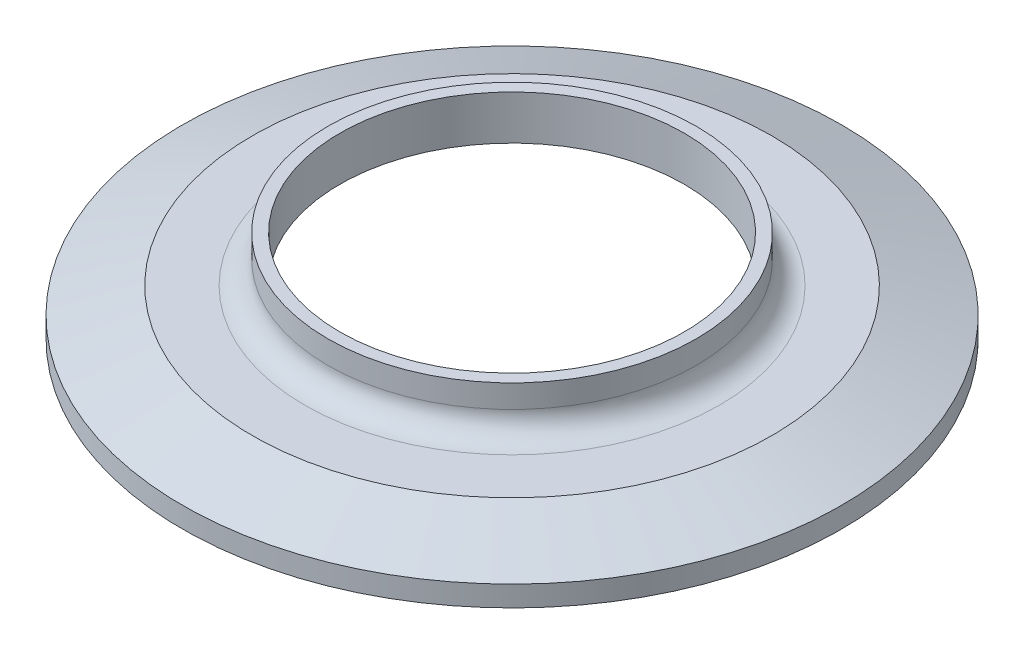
ISO-10303-21;
HEADER;
FILE_DESCRIPTION(('STEP AP214'),'2;1');
FILE_NAME('part.step','',(''),(''),'','','');
FILE_SCHEMA(('AUTOMOTIVE_DESIGN { 1 0 10303 214 1 1 1 1 }'));
ENDSEC;
DATA;
#1=APPLICATION_CONTEXT('core data for automotive mechanical design processes');
#2=APPLICATION_PROTOCOL_DEFINITION('international standard','automotive_design',2000,#1);
#3=PRODUCT_CONTEXT('',#1,'mechanical');
#4=PRODUCT('Part','Part','',(#3));
#5=PRODUCT_RELATED_PRODUCT_CATEGORY('part','',(#4));
#6=PRODUCT_DEFINITION_FORMATION('','',#4);
#7=PRODUCT_DEFINITION_CONTEXT('part definition',#1,'design');
#8=PRODUCT_DEFINITION('design','',#6,#7);
#9=PRODUCT_DEFINITION_SHAPE('','',#8);
#10=(LENGTH_UNIT() NAMED_UNIT(*) SI_UNIT(.MILLI.,.METRE.));
#11=(NAMED_UNIT(*) PLANE_ANGLE_UNIT() SI_UNIT($,.RADIAN.));
#12=(NAMED_UNIT(*) SI_UNIT($,.STERADIAN.) SOLID_ANGLE_UNIT());
#13=UNCERTAINTY_MEASURE_WITH_UNIT(LENGTH_MEASURE(1.E-05),#10,'distance_accuracy_value','');
#14=(GEOMETRIC_REPRESENTATION_CONTEXT(3) GLOBAL_UNCERTAINTY_ASSIGNED_CONTEXT((#13)) GLOBAL_UNIT_ASSIGNED_CONTEXT((#10,
#11,#12)) REPRESENTATION_CONTEXT('',''));
#15=CARTESIAN_POINT('',(0.,0.,0.));
#16=DIRECTION('',(0.,0.,1.));
#17=DIRECTION('',(1.,0.,0.));
#18=AXIS2_PLACEMENT_3D('',#15,#16,#17);
#19=CARTESIAN_POINT('',(-23.749,12.7,0.));
#20=DIRECTION('',(0.,-1.,0.));
#21=DIRECTION('',(0.,0.,-0.999999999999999));
#22=AXIS2_PLACEMENT_3D('',#19,#20,#21);
#23=PLANE('',#22);
#24=CARTESIAN_POINT('',(0.,12.7,0.));
#25=DIRECTION('',(0.,-1.,0.));
#26=DIRECTION('',(0.,0.,-0.999999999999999));
#27=AXIS2_PLACEMENT_3D('',#24,#25,#26);
#28=CIRCLE('',#27,25.4);
#29=CARTESIAN_POINT('',(0.,12.7,-25.4));
#30=VERTEX_POINT('',#29);
#31=EDGE_CURVE('E12',#30,#30,#28,.T.);
#32=ORIENTED_EDGE('',*,*,#31,.F.);
#33=EDGE_LOOP('',(#32));
#34=FACE_BOUND('',#33,.T.);
#35=CARTESIAN_POINT('',(0.,12.7,0.));
#36=DIRECTION('',(0.,-1.,0.));
#37=DIRECTION('',(0.,0.,-0.999999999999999));
#38=AXIS2_PLACEMENT_3D('',#35,#36,#37);
#39=CIRCLE('',#38,23.749);
#40=CARTESIAN_POINT('',(0.,12.7,-23.749));
#41=VERTEX_POINT('',#40);
#42=EDGE_CURVE('E87',#41,#41,#39,.T.);
#43=ORIENTED_EDGE('',*,*,#42,.T.);
#44=EDGE_LOOP('',(#43));
#45=FACE_BOUND('',#44,.T.);
#46=ADVANCED_FACE('F38',(#34,#45),#23,.F.);
#47=CARTESIAN_POINT('',(0.,0.,0.));
#48=DIRECTION('',(0.,-1.,0.));
#49=DIRECTION('',(0.,0.,-0.999999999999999));
#50=AXIS2_PLACEMENT_3D('',#47,#48,#49);
#51=CYLINDRICAL_SURFACE('',#50,25.4);
#52=CARTESIAN_POINT('',(0.,9.52499999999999,0.));
#53=DIRECTION('',(0.,-1.,0.));
#54=DIRECTION('',(0.,0.,-0.999999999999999));
#55=AXIS2_PLACEMENT_3D('',#52,#53,#54);
#56=CIRCLE('',#55,25.4);
#57=CARTESIAN_POINT('',(0.,9.52499999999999,-25.4));
#58=VERTEX_POINT('',#57);
#59=EDGE_CURVE('E44',#58,#58,#56,.T.);
#60=ORIENTED_EDGE('',*,*,#59,.F.);
#61=EDGE_LOOP('',(#60));
#62=FACE_BOUND('',#61,.T.);
#63=ORIENTED_EDGE('',*,*,#31,.T.);
#64=EDGE_LOOP('',(#63));
#65=FACE_BOUND('',#64,.T.);
#66=ADVANCED_FACE('F166',(#62,#65),#51,.T.);
#67=CARTESIAN_POINT('',(0.,9.52499999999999,0.));
#68=DIRECTION('',(0.,-1.,0.));
#69=DIRECTION('',(0.,0.,-0.999999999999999));
#70=AXIS2_PLACEMENT_3D('',#67,#68,#69);
#71=TOROIDAL_SURFACE('',#70,28.575,3.175);
#72=CARTESIAN_POINT('',(0.,6.34999999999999,0.));
#73=DIRECTION('',(0.,-1.,0.));
#74=DIRECTION('',(0.,0.,-0.999999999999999));
#75=AXIS2_PLACEMENT_3D('',#72,#73,#74);
#76=CIRCLE('',#75,28.575);
#77=CARTESIAN_POINT('',(0.,6.34999999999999,-28.575));
#78=VERTEX_POINT('',#77);
#79=EDGE_CURVE('E48',#78,#78,#76,.T.);
#80=ORIENTED_EDGE('',*,*,#79,.F.);
#81=EDGE_LOOP('',(#80));
#82=FACE_BOUND('',#81,.T.);
#83=ORIENTED_EDGE('',*,*,#59,.T.);
#84=EDGE_LOOP('',(#83));
#85=FACE_BOUND('',#84,.T.);
#86=ADVANCED_FACE('F161',(#82,#85),#71,.F.);
#87=CARTESIAN_POINT('',(-28.5749999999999,6.34999999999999,0.));
#88=DIRECTION('',(0.,-1.,0.));
#89=DIRECTION('',(0.,0.,-0.999999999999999));
#90=AXIS2_PLACEMENT_3D('',#87,#88,#89);
#91=PLANE('',#90);
#92=CARTESIAN_POINT('',(0.,6.34999999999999,0.));
#93=DIRECTION('',(0.,-1.,0.));
#94=DIRECTION('',(0.,0.,-0.999999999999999));
#95=AXIS2_PLACEMENT_3D('',#92,#93,#94);
#96=CIRCLE('',#95,35.8228421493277);
#97=CARTESIAN_POINT('',(0.,6.34999999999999,-35.8228421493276));
#98=VERTEX_POINT('',#97);
#99=EDGE_CURVE('E52',#98,#98,#96,.T.);
#100=ORIENTED_EDGE('',*,*,#99,.F.);
#101=EDGE_LOOP('',(#100));
#102=FACE_BOUND('',#101,.T.);
#103=ORIENTED_EDGE('',*,*,#79,.T.);
#104=EDGE_LOOP('',(#103));
#105=FACE_BOUND('',#104,.T.);
#106=ADVANCED_FACE('F155',(#102,#105),#91,.F.);
#107=CARTESIAN_POINT('',(0.,6.34999999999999,0.));
#108=DIRECTION('',(0.,-1.,0.));
#109=DIRECTION('',(0.,0.,-0.999999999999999));
#110=AXIS2_PLACEMENT_3D('',#107,#108,#109);
#111=CONICAL_SURFACE('',#110,35.8228421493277,1.22173047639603);
#112=CARTESIAN_POINT('',(0.,2.84479999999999,0.));
#113=DIRECTION('',(0.,-1.,0.));
#114=DIRECTION('',(0.,0.,-0.999999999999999));
#115=AXIS2_PLACEMENT_3D('',#112,#113,#114);
#116=CIRCLE('',#115,45.4533);
#117=CARTESIAN_POINT('',(0.,2.84479999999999,-45.4533));
#118=VERTEX_POINT('',#117);
#119=EDGE_CURVE('E57',#118,#118,#116,.T.);
#120=ORIENTED_EDGE('',*,*,#119,.F.);
#121=EDGE_LOOP('',(#120));
#122=FACE_BOUND('',#121,.T.);
#123=ORIENTED_EDGE('',*,*,#99,.T.);
#124=EDGE_LOOP('',(#123));
#125=FACE_BOUND('',#124,.T.);
#126=ADVANCED_FACE('F149',(#122,#125),#111,.T.);
#127=CARTESIAN_POINT('',(0.,0.,0.));
#128=DIRECTION('',(0.,-1.,0.));
#129=DIRECTION('',(0.,0.,-0.999999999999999));
#130=AXIS2_PLACEMENT_3D('',#127,#128,#129);
#131=CYLINDRICAL_SURFACE('',#130,45.4533);
#132=CARTESIAN_POINT('',(0.,0.,0.));
#133=DIRECTION('',(0.,-1.,0.));
#134=DIRECTION('',(0.,0.,-0.999999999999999));
#135=AXIS2_PLACEMENT_3D('',#132,#133,#134);
#136=CIRCLE('',#135,45.4533);
#137=CARTESIAN_POINT('',(0.,0.,-45.4533));
#138=VERTEX_POINT('',#137);
#139=EDGE_CURVE('E60',#138,#138,#136,.T.);
#140=ORIENTED_EDGE('',*,*,#139,.F.);
#141=EDGE_LOOP('',(#140));
#142=FACE_BOUND('',#141,.T.);
#143=ORIENTED_EDGE('',*,*,#119,.T.);
#144=EDGE_LOOP('',(#143));
#145=FACE_BOUND('',#144,.T.);
#146=ADVANCED_FACE('F143',(#142,#145),#131,.T.);
#147=CARTESIAN_POINT('',(0.,0.,0.));
#148=DIRECTION('',(0.,-1.,0.));
#149=DIRECTION('',(0.,0.,-0.999999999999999));
#150=AXIS2_PLACEMENT_3D('',#147,#148,#149);
#151=CONICAL_SURFACE('',#150,45.4533,1.56939586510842);
#152=CARTESIAN_POINT('',(0.,0.0025124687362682,0.));
#153=DIRECTION('',(0.,-1.,0.));
#154=DIRECTION('',(0.,0.,-0.999999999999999));
#155=AXIS2_PLACEMENT_3D('',#152,#153,#154);
#156=CIRCLE('',#155,43.6592722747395);
#157=CARTESIAN_POINT('',(0.,0.00251246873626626,-43.6592722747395));
#158=VERTEX_POINT('',#157);
#159=EDGE_CURVE('E63',#158,#158,#156,.T.);
#160=ORIENTED_EDGE('',*,*,#159,.F.);
#161=EDGE_LOOP('',(#160));
#162=FACE_BOUND('',#161,.T.);
#163=ORIENTED_EDGE('',*,*,#139,.T.);
#164=EDGE_LOOP('',(#163));
#165=FACE_BOUND('',#164,.T.);
#166=ADVANCED_FACE('F137',(#162,#165),#151,.F.);
#167=CARTESIAN_POINT('',(0.,0.789912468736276,0.));
#168=DIRECTION('',(0.,-1.,0.));
#169=DIRECTION('',(0.,0.,-0.999999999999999));
#170=AXIS2_PLACEMENT_3D('',#167,#168,#169);
#171=TOROIDAL_SURFACE('',#170,43.6592722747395,0.787399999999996);
#172=CARTESIAN_POINT('',(0.,0.482250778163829,0.));
#173=DIRECTION('',(0.,-1.,0.));
#174=DIRECTION('',(0.,0.,-0.999999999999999));
#175=AXIS2_PLACEMENT_3D('',#172,#173,#174);
#176=CIRCLE('',#175,42.9344667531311);
#177=CARTESIAN_POINT('',(0.,0.482250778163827,-42.934466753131));
#178=VERTEX_POINT('',#177);
#179=EDGE_CURVE('E66',#178,#178,#176,.T.);
#180=ORIENTED_EDGE('',*,*,#179,.F.);
#181=EDGE_LOOP('',(#180));
#182=FACE_BOUND('',#181,.T.);
#183=ORIENTED_EDGE('',*,*,#159,.T.);
#184=EDGE_LOOP('',(#183));
#185=FACE_BOUND('',#184,.T.);
#186=ADVANCED_FACE('F131',(#182,#185),#171,.T.);
#187=CARTESIAN_POINT('',(0.,0.482250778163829,0.));
#188=DIRECTION('',(0.,-1.,0.));
#189=DIRECTION('',(0.,0.,-0.999999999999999));
#190=AXIS2_PLACEMENT_3D('',#187,#188,#189);
#191=CONICAL_SURFACE('',#190,42.9344667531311,0.401425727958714);
#192=CARTESIAN_POINT('',(0.,0.875367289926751,0.));
#193=DIRECTION('',(0.,-1.,0.));
#194=DIRECTION('',(0.,0.,-0.999999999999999));
#195=AXIS2_PLACEMENT_3D('',#192,#193,#194);
#196=CIRCLE('',#195,42.7675986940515);
#197=CARTESIAN_POINT('',(0.,0.875367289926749,-42.7675986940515));
#198=VERTEX_POINT('',#197);
#199=EDGE_CURVE('E69',#198,#198,#196,.T.);
#200=ORIENTED_EDGE('',*,*,#199,.F.);
#201=EDGE_LOOP('',(#200));
#202=FACE_BOUND('',#201,.T.);
#203=ORIENTED_EDGE('',*,*,#179,.T.);
#204=EDGE_LOOP('',(#203));
#205=FACE_BOUND('',#204,.T.);
#206=ADVANCED_FACE('F125',(#202,#205),#191,.F.);
#207=CARTESIAN_POINT('',(0.,0.408912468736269,0.));
#208=DIRECTION('',(0.,-1.,0.));
#209=DIRECTION('',(0.,0.,-0.999999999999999));
#210=AXIS2_PLACEMENT_3D('',#207,#208,#209);
#211=TOROIDAL_SURFACE('',#210,41.6687,1.19379999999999);
#212=CARTESIAN_POINT('',(0.,0.875367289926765,0.));
#213=DIRECTION('',(0.,-1.,0.));
#214=DIRECTION('',(0.,0.,-0.999999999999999));
#215=AXIS2_PLACEMENT_3D('',#212,#213,#214);
#216=CIRCLE('',#215,40.5698013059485);
#217=CARTESIAN_POINT('',(0.,0.875367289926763,-40.5698013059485));
#218=VERTEX_POINT('',#217);
#219=EDGE_CURVE('E72',#218,#218,#216,.T.);
#220=ORIENTED_EDGE('',*,*,#219,.F.);
#221=EDGE_LOOP('',(#220));
#222=FACE_BOUND('',#221,.T.);
#223=ORIENTED_EDGE('',*,*,#199,.T.);
#224=EDGE_LOOP('',(#223));
#225=FACE_BOUND('',#224,.T.);
#226=ADVANCED_FACE('F119',(#222,#225),#211,.F.);
#227=CARTESIAN_POINT('',(0.,0.875367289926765,0.));
#228=DIRECTION('',(0.,1.,0.));
#229=DIRECTION('',(0.,0.,0.999999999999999));
#230=AXIS2_PLACEMENT_3D('',#227,#228,#229);
#231=CONICAL_SURFACE('',#230,40.5698013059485,0.401425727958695);
#232=CARTESIAN_POINT('',(0.,0.482250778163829,0.));
#233=DIRECTION('',(0.,-1.,0.));
#234=DIRECTION('',(0.,0.,-0.999999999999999));
#235=AXIS2_PLACEMENT_3D('',#232,#233,#234);
#236=CIRCLE('',#235,40.402933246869);
#237=CARTESIAN_POINT('',(0.,0.482250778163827,-40.4029332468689));
#238=VERTEX_POINT('',#237);
#239=EDGE_CURVE('E75',#238,#238,#236,.T.);
#240=ORIENTED_EDGE('',*,*,#239,.F.);
#241=EDGE_LOOP('',(#240));
#242=FACE_BOUND('',#241,.T.);
#243=ORIENTED_EDGE('',*,*,#219,.T.);
#244=EDGE_LOOP('',(#243));
#245=FACE_BOUND('',#244,.T.);
#246=ADVANCED_FACE('F113',(#242,#245),#231,.T.);
#247=CARTESIAN_POINT('',(0.,0.789912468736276,0.));
#248=DIRECTION('',(0.,-1.,0.));
#249=DIRECTION('',(0.,0.,-0.999999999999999));
#250=AXIS2_PLACEMENT_3D('',#247,#248,#249);
#251=TOROIDAL_SURFACE('',#250,39.6781277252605,0.787399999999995);
#252=CARTESIAN_POINT('',(0.,0.0025124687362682,0.));
#253=DIRECTION('',(0.,-1.,0.));
#254=DIRECTION('',(0.,0.,-0.999999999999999));
#255=AXIS2_PLACEMENT_3D('',#252,#253,#254);
#256=CIRCLE('',#255,39.6781277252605);
#257=CARTESIAN_POINT('',(0.,0.00251246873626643,-39.6781277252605));
#258=VERTEX_POINT('',#257);
#259=EDGE_CURVE('E78',#258,#258,#256,.T.);
#260=ORIENTED_EDGE('',*,*,#259,.F.);
#261=EDGE_LOOP('',(#260));
#262=FACE_BOUND('',#261,.T.);
#263=ORIENTED_EDGE('',*,*,#239,.T.);
#264=EDGE_LOOP('',(#263));
#265=FACE_BOUND('',#264,.T.);
#266=ADVANCED_FACE('F107',(#262,#265),#251,.T.);
#267=CARTESIAN_POINT('',(0.,0.0025124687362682,0.));
#268=DIRECTION('',(0.,1.,0.));
#269=DIRECTION('',(0.,0.,0.999999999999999));
#270=AXIS2_PLACEMENT_3D('',#267,#268,#269);
#271=CONICAL_SURFACE('',#270,39.6781277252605,1.57001826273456);
#272=CARTESIAN_POINT('',(0.,0.,0.));
#273=DIRECTION('',(0.,-1.,0.));
#274=DIRECTION('',(0.,0.,-0.999999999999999));
#275=AXIS2_PLACEMENT_3D('',#272,#273,#274);
#276=CIRCLE('',#275,36.449);
#277=CARTESIAN_POINT('',(0.,0.,-36.449));
#278=VERTEX_POINT('',#277);
#279=EDGE_CURVE('E81',#278,#278,#276,.T.);
#280=ORIENTED_EDGE('',*,*,#279,.F.);
#281=EDGE_LOOP('',(#280));
#282=FACE_BOUND('',#281,.T.);
#283=ORIENTED_EDGE('',*,*,#259,.T.);
#284=EDGE_LOOP('',(#283));
#285=FACE_BOUND('',#284,.T.);
#286=ADVANCED_FACE('F101',(#282,#285),#271,.T.);
#287=CARTESIAN_POINT('',(0.,0.,0.));
#288=DIRECTION('',(0.,-1.,0.));
#289=DIRECTION('',(0.,0.,-0.999999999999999));
#290=AXIS2_PLACEMENT_3D('',#287,#288,#289);
#291=CONICAL_SURFACE('',#290,36.449,1.09205251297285);
#292=CARTESIAN_POINT('',(0.,6.59149341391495,0.));
#293=DIRECTION('',(0.,-1.,0.));
#294=DIRECTION('',(0.,0.,-0.999999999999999));
#295=AXIS2_PLACEMENT_3D('',#292,#293,#294);
#296=CIRCLE('',#295,23.749);
#297=CARTESIAN_POINT('',(0.,6.59149341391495,-23.749));
#298=VERTEX_POINT('',#297);
#299=EDGE_CURVE('E84',#298,#298,#296,.T.);
#300=ORIENTED_EDGE('',*,*,#299,.F.);
#301=EDGE_LOOP('',(#300));
#302=FACE_BOUND('',#301,.T.);
#303=ORIENTED_EDGE('',*,*,#279,.T.);
#304=EDGE_LOOP('',(#303));
#305=FACE_BOUND('',#304,.T.);
#306=ADVANCED_FACE('F95',(#302,#305),#291,.F.);
#307=CARTESIAN_POINT('',(0.,0.,0.));
#308=DIRECTION('',(0.,-1.,0.));
#309=DIRECTION('',(0.,0.,-0.999999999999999));
#310=AXIS2_PLACEMENT_3D('',#307,#308,#309);
#311=CYLINDRICAL_SURFACE('',#310,23.749);
#312=ORIENTED_EDGE('',*,*,#42,.F.);
#313=EDGE_LOOP('',(#312));
#314=FACE_BOUND('',#313,.T.);
#315=ORIENTED_EDGE('',*,*,#299,.T.);
#316=EDGE_LOOP('',(#315));
#317=FACE_BOUND('',#316,.T.);
#318=ADVANCED_FACE('F92',(#314,#317),#311,.F.);
#319=CLOSED_SHELL('',(#46,#66,#86,#106,#126,#146,#166,#186,#206,#226,#246,#266,#286,#306,#318));
#320=MANIFOLD_SOLID_BREP('B2',#319);
#321=ADVANCED_BREP_SHAPE_REPRESENTATION('',(#18,#320),#14);
#322=SHAPE_DEFINITION_REPRESENTATION(#9,#321);
ENDSEC;
END-ISO-10303-21;
